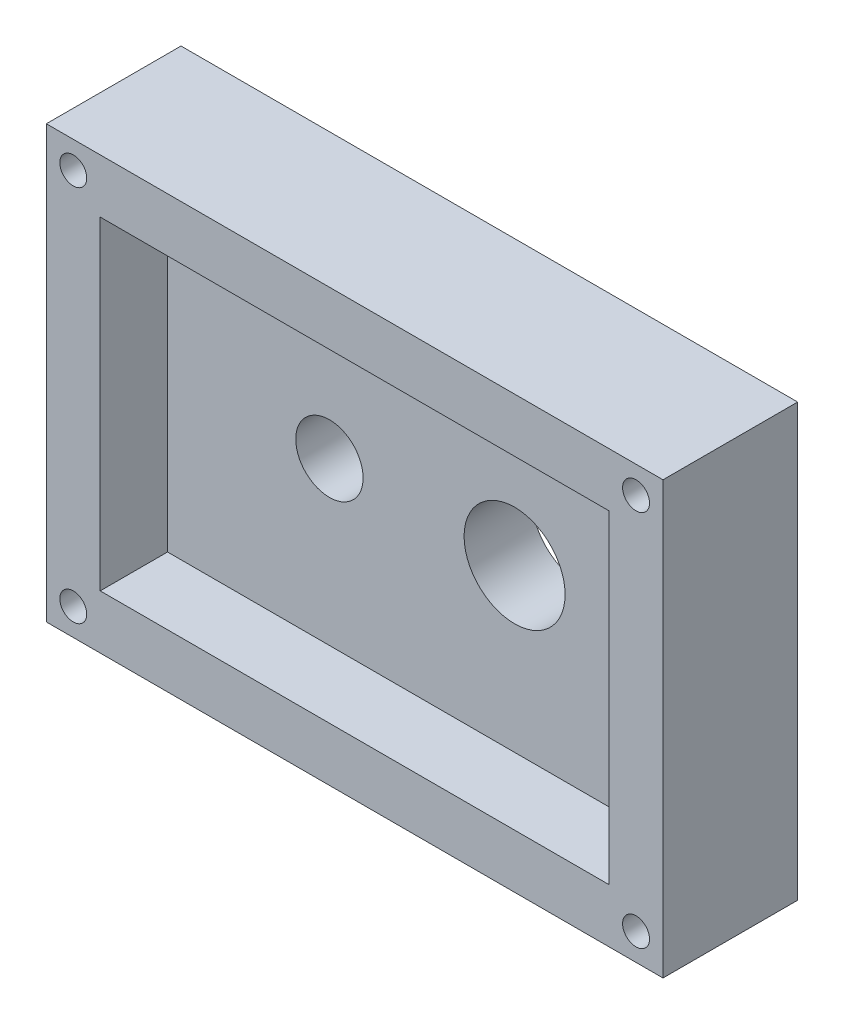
ISO-10303-21;
HEADER;
FILE_DESCRIPTION(('STEP AP214'),'2;1');
FILE_NAME('part.step','',(''),(''),'','','');
FILE_SCHEMA(('AUTOMOTIVE_DESIGN { 1 0 10303 214 1 1 1 1 }'));
ENDSEC;
DATA;
#1=APPLICATION_CONTEXT('core data for automotive mechanical design processes');
#2=APPLICATION_PROTOCOL_DEFINITION('international standard','automotive_design',2000,#1);
#3=PRODUCT_CONTEXT('',#1,'mechanical');
#4=PRODUCT('Part','Part','',(#3));
#5=PRODUCT_RELATED_PRODUCT_CATEGORY('part','',(#4));
#6=PRODUCT_DEFINITION_FORMATION('','',#4);
#7=PRODUCT_DEFINITION_CONTEXT('part definition',#1,'design');
#8=PRODUCT_DEFINITION('design','',#6,#7);
#9=PRODUCT_DEFINITION_SHAPE('','',#8);
#10=(LENGTH_UNIT() NAMED_UNIT(*) SI_UNIT(.MILLI.,.METRE.));
#11=(NAMED_UNIT(*) PLANE_ANGLE_UNIT() SI_UNIT($,.RADIAN.));
#12=(NAMED_UNIT(*) SI_UNIT($,.STERADIAN.) SOLID_ANGLE_UNIT());
#13=UNCERTAINTY_MEASURE_WITH_UNIT(LENGTH_MEASURE(1.E-05),#10,'distance_accuracy_value','');
#14=(GEOMETRIC_REPRESENTATION_CONTEXT(3) GLOBAL_UNCERTAINTY_ASSIGNED_CONTEXT((#13)) GLOBAL_UNIT_ASSIGNED_CONTEXT((#10,
#11,#12)) REPRESENTATION_CONTEXT('',''));
#15=CARTESIAN_POINT('',(0.,0.,0.));
#16=DIRECTION('',(0.,0.,1.));
#17=DIRECTION('',(1.,0.,0.));
#18=AXIS2_PLACEMENT_3D('',#15,#16,#17);
#19=CARTESIAN_POINT('',(29.07665,-20.3454,-12.7));
#20=DIRECTION('',(1.,0.,0.));
#21=DIRECTION('',(0.,0.,-1.));
#22=AXIS2_PLACEMENT_3D('',#19,#20,#21);
#23=PLANE('',#22);
#24=DIRECTION('',(0.,1.,0.));
#25=VECTOR('',#24,1.);
#26=CARTESIAN_POINT('',(29.07665,-20.3454,0.));
#27=LINE('',#26,#25);
#28=CARTESIAN_POINT('',(29.07665,-20.3454,0.));
#29=VERTEX_POINT('',#28);
#30=CARTESIAN_POINT('',(29.07665,20.3454,0.));
#31=VERTEX_POINT('',#30);
#32=EDGE_CURVE('E155',#29,#31,#27,.T.);
#33=ORIENTED_EDGE('',*,*,#32,.F.);
#34=DIRECTION('',(0.,0.,1.));
#35=VECTOR('',#34,1.);
#36=CARTESIAN_POINT('',(29.07665,-20.3454,-12.7));
#37=LINE('',#36,#35);
#38=CARTESIAN_POINT('',(29.07665,-20.3454,-12.7));
#39=VERTEX_POINT('',#38);
#40=EDGE_CURVE('E11',#39,#29,#37,.T.);
#41=ORIENTED_EDGE('',*,*,#40,.F.);
#42=DIRECTION('',(0.,1.,0.));
#43=VECTOR('',#42,1.);
#44=CARTESIAN_POINT('',(29.07665,-20.3454,-12.7));
#45=LINE('',#44,#43);
#46=CARTESIAN_POINT('',(29.07665,20.3454,-12.7));
#47=VERTEX_POINT('',#46);
#48=EDGE_CURVE('E156',#39,#47,#45,.T.);
#49=ORIENTED_EDGE('',*,*,#48,.T.);
#50=DIRECTION('',(0.,0.,1.));
#51=VECTOR('',#50,1.);
#52=CARTESIAN_POINT('',(29.07665,20.3454,-12.7));
#53=LINE('',#52,#51);
#54=EDGE_CURVE('E89',#47,#31,#53,.T.);
#55=ORIENTED_EDGE('',*,*,#54,.T.);
#56=EDGE_LOOP('',(#33,#41,#49,#55));
#57=FACE_BOUND('',#56,.T.);
#58=ADVANCED_FACE('F41',(#57),#23,.T.);
#59=CARTESIAN_POINT('',(-29.07665,-20.3454,-12.7));
#60=DIRECTION('',(0.,-1.,0.));
#61=DIRECTION('',(0.,0.,-1.));
#62=AXIS2_PLACEMENT_3D('',#59,#60,#61);
#63=PLANE('',#62);
#64=DIRECTION('',(1.,0.,0.));
#65=VECTOR('',#64,1.);
#66=CARTESIAN_POINT('',(-29.07665,-20.3454,0.));
#67=LINE('',#66,#65);
#68=CARTESIAN_POINT('',(-29.07665,-20.3454,0.));
#69=VERTEX_POINT('',#68);
#70=EDGE_CURVE('E157',#69,#29,#67,.T.);
#71=ORIENTED_EDGE('',*,*,#70,.F.);
#72=DIRECTION('',(0.,0.,1.));
#73=VECTOR('',#72,1.);
#74=CARTESIAN_POINT('',(-29.07665,-20.3454,-12.7));
#75=LINE('',#74,#73);
#76=CARTESIAN_POINT('',(-29.07665,-20.3454,-12.7));
#77=VERTEX_POINT('',#76);
#78=EDGE_CURVE('E47',#77,#69,#75,.T.);
#79=ORIENTED_EDGE('',*,*,#78,.F.);
#80=DIRECTION('',(1.,0.,0.));
#81=VECTOR('',#80,1.);
#82=CARTESIAN_POINT('',(-29.07665,-20.3454,-12.7));
#83=LINE('',#82,#81);
#84=EDGE_CURVE('E163',#77,#39,#83,.T.);
#85=ORIENTED_EDGE('',*,*,#84,.T.);
#86=ORIENTED_EDGE('',*,*,#40,.T.);
#87=EDGE_LOOP('',(#71,#79,#85,#86));
#88=FACE_BOUND('',#87,.T.);
#89=ADVANCED_FACE('F235',(#88),#63,.T.);
#90=CARTESIAN_POINT('',(-29.07665,-20.3454,-12.7));
#91=DIRECTION('',(-1.,0.,0.));
#92=DIRECTION('',(0.,0.,1.));
#93=AXIS2_PLACEMENT_3D('',#90,#91,#92);
#94=PLANE('',#93);
#95=DIRECTION('',(0.,-1.,0.));
#96=VECTOR('',#95,1.);
#97=CARTESIAN_POINT('',(-29.07665,-20.3454,0.));
#98=LINE('',#97,#96);
#99=CARTESIAN_POINT('',(-29.07665,20.3454,0.));
#100=VERTEX_POINT('',#99);
#101=EDGE_CURVE('E174',#100,#69,#98,.T.);
#102=ORIENTED_EDGE('',*,*,#101,.F.);
#103=DIRECTION('',(0.,0.,1.));
#104=VECTOR('',#103,1.);
#105=CARTESIAN_POINT('',(-29.07665,20.3454,-12.7));
#106=LINE('',#105,#104);
#107=CARTESIAN_POINT('',(-29.07665,20.3454,-12.7));
#108=VERTEX_POINT('',#107);
#109=EDGE_CURVE('E180',#108,#100,#106,.T.);
#110=ORIENTED_EDGE('',*,*,#109,.F.);
#111=DIRECTION('',(0.,-1.,0.));
#112=VECTOR('',#111,1.);
#113=CARTESIAN_POINT('',(-29.07665,-20.3454,-12.7));
#114=LINE('',#113,#112);
#115=EDGE_CURVE('E161',#108,#77,#114,.T.);
#116=ORIENTED_EDGE('',*,*,#115,.T.);
#117=ORIENTED_EDGE('',*,*,#78,.T.);
#118=EDGE_LOOP('',(#102,#110,#116,#117));
#119=FACE_BOUND('',#118,.T.);
#120=ADVANCED_FACE('F232',(#119),#94,.T.);
#121=CARTESIAN_POINT('',(-29.07665,20.3454,-12.7));
#122=DIRECTION('',(0.,1.,0.));
#123=DIRECTION('',(0.,0.,1.));
#124=AXIS2_PLACEMENT_3D('',#121,#122,#123);
#125=PLANE('',#124);
#126=DIRECTION('',(-1.,0.,0.));
#127=VECTOR('',#126,1.);
#128=CARTESIAN_POINT('',(-29.07665,20.3454,0.));
#129=LINE('',#128,#127);
#130=EDGE_CURVE('E169',#31,#100,#129,.T.);
#131=ORIENTED_EDGE('',*,*,#130,.F.);
#132=ORIENTED_EDGE('',*,*,#54,.F.);
#133=DIRECTION('',(-1.,0.,0.));
#134=VECTOR('',#133,1.);
#135=CARTESIAN_POINT('',(-29.07665,20.3454,-12.7));
#136=LINE('',#135,#134);
#137=EDGE_CURVE('E158',#47,#108,#136,.T.);
#138=ORIENTED_EDGE('',*,*,#137,.T.);
#139=ORIENTED_EDGE('',*,*,#109,.T.);
#140=EDGE_LOOP('',(#131,#132,#138,#139));
#141=FACE_BOUND('',#140,.T.);
#142=ADVANCED_FACE('F226',(#141),#125,.T.);
#143=CARTESIAN_POINT('',(0.,0.,-12.7));
#144=DIRECTION('',(0.,0.,-1.));
#145=DIRECTION('',(-1.,0.,0.));
#146=AXIS2_PLACEMENT_3D('',#143,#144,#145);
#147=PLANE('',#146);
#148=CARTESIAN_POINT('',(-26.53665,17.8054,-12.7));
#149=DIRECTION('',(0.,0.,1.));
#150=DIRECTION('',(1.,0.,0.));
#151=AXIS2_PLACEMENT_3D('',#148,#149,#150);
#152=CIRCLE('',#151,1.27);
#153=CARTESIAN_POINT('',(-25.26665,17.8054,-12.7));
#154=VERTEX_POINT('',#153);
#155=EDGE_CURVE('E204',#154,#154,#152,.T.);
#156=ORIENTED_EDGE('',*,*,#155,.T.);
#157=EDGE_LOOP('',(#156));
#158=FACE_BOUND('',#157,.T.);
#159=CARTESIAN_POINT('',(26.53665,-17.8054,-12.7));
#160=DIRECTION('',(0.,0.,1.));
#161=DIRECTION('',(1.,0.,0.));
#162=AXIS2_PLACEMENT_3D('',#159,#160,#161);
#163=CIRCLE('',#162,1.27);
#164=CARTESIAN_POINT('',(27.80665,-17.8054,-12.7));
#165=VERTEX_POINT('',#164);
#166=EDGE_CURVE('E197',#165,#165,#163,.T.);
#167=ORIENTED_EDGE('',*,*,#166,.T.);
#168=EDGE_LOOP('',(#167));
#169=FACE_BOUND('',#168,.T.);
#170=CARTESIAN_POINT('',(-26.53665,-17.8054,-12.7));
#171=DIRECTION('',(0.,0.,1.));
#172=DIRECTION('',(1.,0.,0.));
#173=AXIS2_PLACEMENT_3D('',#170,#171,#172);
#174=CIRCLE('',#173,1.27);
#175=CARTESIAN_POINT('',(-25.26665,-17.8054,-12.7));
#176=VERTEX_POINT('',#175);
#177=EDGE_CURVE('E207',#176,#176,#174,.T.);
#178=ORIENTED_EDGE('',*,*,#177,.T.);
#179=EDGE_LOOP('',(#178));
#180=FACE_BOUND('',#179,.T.);
#181=CARTESIAN_POINT('',(26.53665,17.8054,-12.7));
#182=DIRECTION('',(0.,0.,1.));
#183=DIRECTION('',(1.,0.,0.));
#184=AXIS2_PLACEMENT_3D('',#181,#182,#183);
#185=CIRCLE('',#184,1.27);
#186=CARTESIAN_POINT('',(27.80665,17.8054,-12.7));
#187=VERTEX_POINT('',#186);
#188=EDGE_CURVE('E188',#187,#187,#185,.T.);
#189=ORIENTED_EDGE('',*,*,#188,.T.);
#190=EDGE_LOOP('',(#189));
#191=FACE_BOUND('',#190,.T.);
#192=CARTESIAN_POINT('',(-8.73125,0.,-12.7));
#193=DIRECTION('',(0.,0.,1.));
#194=DIRECTION('',(1.,0.,0.));
#195=AXIS2_PLACEMENT_3D('',#192,#193,#194);
#196=CIRCLE('',#195,3.175);
#197=CARTESIAN_POINT('',(-5.55625,0.,-12.7));
#198=VERTEX_POINT('',#197);
#199=EDGE_CURVE('E182',#198,#198,#196,.T.);
#200=ORIENTED_EDGE('',*,*,#199,.T.);
#201=EDGE_LOOP('',(#200));
#202=FACE_BOUND('',#201,.T.);
#203=CARTESIAN_POINT('',(8.73125,0.,-12.7));
#204=DIRECTION('',(0.,0.,1.));
#205=DIRECTION('',(1.,0.,0.));
#206=AXIS2_PLACEMENT_3D('',#203,#204,#205);
#207=CIRCLE('',#206,4.7625);
#208=CARTESIAN_POINT('',(13.49375,0.,-12.7));
#209=VERTEX_POINT('',#208);
#210=EDGE_CURVE('E136',#209,#209,#207,.T.);
#211=ORIENTED_EDGE('',*,*,#210,.T.);
#212=EDGE_LOOP('',(#211));
#213=FACE_BOUND('',#212,.T.);
#214=ORIENTED_EDGE('',*,*,#48,.F.);
#215=ORIENTED_EDGE('',*,*,#84,.F.);
#216=ORIENTED_EDGE('',*,*,#115,.F.);
#217=ORIENTED_EDGE('',*,*,#137,.F.);
#218=EDGE_LOOP('',(#214,#215,#216,#217));
#219=FACE_BOUND('',#218,.T.);
#220=ADVANCED_FACE('F219',(#158,#169,#180,#191,#202,#213,#219),#147,.T.);
#221=CARTESIAN_POINT('',(0.,0.,0.));
#222=DIRECTION('',(0.,0.,-1.));
#223=DIRECTION('',(-1.,0.,0.));
#224=AXIS2_PLACEMENT_3D('',#221,#222,#223);
#225=PLANE('',#224);
#226=CARTESIAN_POINT('',(-26.53665,17.8054,0.));
#227=DIRECTION('',(0.,0.,1.));
#228=DIRECTION('',(1.,0.,0.));
#229=AXIS2_PLACEMENT_3D('',#226,#227,#228);
#230=CIRCLE('',#229,1.27);
#231=CARTESIAN_POINT('',(-25.26665,17.8054,0.));
#232=VERTEX_POINT('',#231);
#233=EDGE_CURVE('E194',#232,#232,#230,.T.);
#234=ORIENTED_EDGE('',*,*,#233,.F.);
#235=EDGE_LOOP('',(#234));
#236=FACE_BOUND('',#235,.T.);
#237=CARTESIAN_POINT('',(26.53665,-17.8054,0.));
#238=DIRECTION('',(0.,0.,1.));
#239=DIRECTION('',(1.,0.,0.));
#240=AXIS2_PLACEMENT_3D('',#237,#238,#239);
#241=CIRCLE('',#240,1.27);
#242=CARTESIAN_POINT('',(27.80665,-17.8054,0.));
#243=VERTEX_POINT('',#242);
#244=EDGE_CURVE('E199',#243,#243,#241,.T.);
#245=ORIENTED_EDGE('',*,*,#244,.F.);
#246=EDGE_LOOP('',(#245));
#247=FACE_BOUND('',#246,.T.);
#248=CARTESIAN_POINT('',(-26.53665,-17.8054,0.));
#249=DIRECTION('',(0.,0.,1.));
#250=DIRECTION('',(1.,0.,0.));
#251=AXIS2_PLACEMENT_3D('',#248,#249,#250);
#252=CIRCLE('',#251,1.27);
#253=CARTESIAN_POINT('',(-25.26665,-17.8054,0.));
#254=VERTEX_POINT('',#253);
#255=EDGE_CURVE('E203',#254,#254,#252,.T.);
#256=ORIENTED_EDGE('',*,*,#255,.F.);
#257=EDGE_LOOP('',(#256));
#258=FACE_BOUND('',#257,.T.);
#259=CARTESIAN_POINT('',(26.53665,17.8054,0.));
#260=DIRECTION('',(0.,0.,1.));
#261=DIRECTION('',(1.,0.,0.));
#262=AXIS2_PLACEMENT_3D('',#259,#260,#261);
#263=CIRCLE('',#262,1.27);
#264=CARTESIAN_POINT('',(27.80665,17.8054,0.));
#265=VERTEX_POINT('',#264);
#266=EDGE_CURVE('E192',#265,#265,#263,.T.);
#267=ORIENTED_EDGE('',*,*,#266,.F.);
#268=EDGE_LOOP('',(#267));
#269=FACE_BOUND('',#268,.T.);
#270=DIRECTION('',(-1.,0.,0.));
#271=VECTOR('',#270,1.);
#272=CARTESIAN_POINT('',(-23.99665,15.2654,0.));
#273=LINE('',#272,#271);
#274=CARTESIAN_POINT('',(23.99665,15.2654,0.));
#275=VERTEX_POINT('',#274);
#276=CARTESIAN_POINT('',(-23.99665,15.2654,0.));
#277=VERTEX_POINT('',#276);
#278=EDGE_CURVE('E148',#275,#277,#273,.T.);
#279=ORIENTED_EDGE('',*,*,#278,.F.);
#280=DIRECTION('',(0.,1.,0.));
#281=VECTOR('',#280,1.);
#282=CARTESIAN_POINT('',(23.99665,-15.2654,0.));
#283=LINE('',#282,#281);
#284=CARTESIAN_POINT('',(23.99665,-15.2654,0.));
#285=VERTEX_POINT('',#284);
#286=EDGE_CURVE('E60',#285,#275,#283,.T.);
#287=ORIENTED_EDGE('',*,*,#286,.F.);
#288=DIRECTION('',(1.,0.,0.));
#289=VECTOR('',#288,1.);
#290=CARTESIAN_POINT('',(-23.99665,-15.2654,0.));
#291=LINE('',#290,#289);
#292=CARTESIAN_POINT('',(-23.99665,-15.2654,0.));
#293=VERTEX_POINT('',#292);
#294=EDGE_CURVE('E133',#293,#285,#291,.T.);
#295=ORIENTED_EDGE('',*,*,#294,.F.);
#296=DIRECTION('',(0.,-1.,0.));
#297=VECTOR('',#296,1.);
#298=CARTESIAN_POINT('',(-23.99665,-15.2654,0.));
#299=LINE('',#298,#297);
#300=EDGE_CURVE('E140',#277,#293,#299,.T.);
#301=ORIENTED_EDGE('',*,*,#300,.F.);
#302=EDGE_LOOP('',(#279,#287,#295,#301));
#303=FACE_BOUND('',#302,.T.);
#304=ORIENTED_EDGE('',*,*,#32,.T.);
#305=ORIENTED_EDGE('',*,*,#130,.T.);
#306=ORIENTED_EDGE('',*,*,#101,.T.);
#307=ORIENTED_EDGE('',*,*,#70,.T.);
#308=EDGE_LOOP('',(#304,#305,#306,#307));
#309=FACE_BOUND('',#308,.T.);
#310=ADVANCED_FACE('F220',(#236,#247,#258,#269,#303,#309),#225,.F.);
#311=CARTESIAN_POINT('',(23.99665,-15.2654,-6.35));
#312=DIRECTION('',(1.,0.,0.));
#313=DIRECTION('',(0.,0.,-1.));
#314=AXIS2_PLACEMENT_3D('',#311,#312,#313);
#315=PLANE('',#314);
#316=ORIENTED_EDGE('',*,*,#286,.T.);
#317=DIRECTION('',(0.,0.,1.));
#318=VECTOR('',#317,1.);
#319=CARTESIAN_POINT('',(23.99665,15.2654,-6.35));
#320=LINE('',#319,#318);
#321=CARTESIAN_POINT('',(23.99665,15.2654,-6.35));
#322=VERTEX_POINT('',#321);
#323=EDGE_CURVE('E115',#322,#275,#320,.T.);
#324=ORIENTED_EDGE('',*,*,#323,.F.);
#325=DIRECTION('',(0.,1.,0.));
#326=VECTOR('',#325,1.);
#327=CARTESIAN_POINT('',(23.99665,-15.2654,-6.35));
#328=LINE('',#327,#326);
#329=CARTESIAN_POINT('',(23.99665,-15.2654,-6.35));
#330=VERTEX_POINT('',#329);
#331=EDGE_CURVE('E119',#330,#322,#328,.T.);
#332=ORIENTED_EDGE('',*,*,#331,.F.);
#333=DIRECTION('',(0.,0.,1.));
#334=VECTOR('',#333,1.);
#335=CARTESIAN_POINT('',(23.99665,-15.2654,-6.35));
#336=LINE('',#335,#334);
#337=EDGE_CURVE('E147',#330,#285,#336,.T.);
#338=ORIENTED_EDGE('',*,*,#337,.T.);
#339=EDGE_LOOP('',(#316,#324,#332,#338));
#340=FACE_BOUND('',#339,.T.);
#341=ADVANCED_FACE('F111',(#340),#315,.F.);
#342=CARTESIAN_POINT('',(-23.99665,-15.2654,-6.35));
#343=DIRECTION('',(0.,-1.,0.));
#344=DIRECTION('',(0.,0.,-1.));
#345=AXIS2_PLACEMENT_3D('',#342,#343,#344);
#346=PLANE('',#345);
#347=ORIENTED_EDGE('',*,*,#294,.T.);
#348=ORIENTED_EDGE('',*,*,#337,.F.);
#349=DIRECTION('',(1.,0.,0.));
#350=VECTOR('',#349,1.);
#351=CARTESIAN_POINT('',(-23.99665,-15.2654,-6.35));
#352=LINE('',#351,#350);
#353=CARTESIAN_POINT('',(-23.99665,-15.2654,-6.35));
#354=VERTEX_POINT('',#353);
#355=EDGE_CURVE('E125',#354,#330,#352,.T.);
#356=ORIENTED_EDGE('',*,*,#355,.F.);
#357=DIRECTION('',(0.,0.,1.));
#358=VECTOR('',#357,1.);
#359=CARTESIAN_POINT('',(-23.99665,-15.2654,-6.35));
#360=LINE('',#359,#358);
#361=EDGE_CURVE('E153',#354,#293,#360,.T.);
#362=ORIENTED_EDGE('',*,*,#361,.T.);
#363=EDGE_LOOP('',(#347,#348,#356,#362));
#364=FACE_BOUND('',#363,.T.);
#365=ADVANCED_FACE('F270',(#364),#346,.F.);
#366=CARTESIAN_POINT('',(-23.99665,-15.2654,-6.35));
#367=DIRECTION('',(-1.,0.,0.));
#368=DIRECTION('',(0.,0.,1.));
#369=AXIS2_PLACEMENT_3D('',#366,#367,#368);
#370=PLANE('',#369);
#371=ORIENTED_EDGE('',*,*,#300,.T.);
#372=ORIENTED_EDGE('',*,*,#361,.F.);
#373=DIRECTION('',(0.,-1.,0.));
#374=VECTOR('',#373,1.);
#375=CARTESIAN_POINT('',(-23.99665,-15.2654,-6.35));
#376=LINE('',#375,#374);
#377=CARTESIAN_POINT('',(-23.99665,15.2654,-6.35));
#378=VERTEX_POINT('',#377);
#379=EDGE_CURVE('E128',#378,#354,#376,.T.);
#380=ORIENTED_EDGE('',*,*,#379,.F.);
#381=DIRECTION('',(0.,0.,1.));
#382=VECTOR('',#381,1.);
#383=CARTESIAN_POINT('',(-23.99665,15.2654,-6.35));
#384=LINE('',#383,#382);
#385=EDGE_CURVE('E122',#378,#277,#384,.T.);
#386=ORIENTED_EDGE('',*,*,#385,.T.);
#387=EDGE_LOOP('',(#371,#372,#380,#386));
#388=FACE_BOUND('',#387,.T.);
#389=ADVANCED_FACE('F274',(#388),#370,.F.);
#390=CARTESIAN_POINT('',(-23.99665,15.2654,-6.35));
#391=DIRECTION('',(0.,1.,0.));
#392=DIRECTION('',(0.,0.,1.));
#393=AXIS2_PLACEMENT_3D('',#390,#391,#392);
#394=PLANE('',#393);
#395=ORIENTED_EDGE('',*,*,#278,.T.);
#396=ORIENTED_EDGE('',*,*,#385,.F.);
#397=DIRECTION('',(-1.,0.,0.));
#398=VECTOR('',#397,1.);
#399=CARTESIAN_POINT('',(-23.99665,15.2654,-6.35));
#400=LINE('',#399,#398);
#401=EDGE_CURVE('E121',#322,#378,#400,.T.);
#402=ORIENTED_EDGE('',*,*,#401,.F.);
#403=ORIENTED_EDGE('',*,*,#323,.T.);
#404=EDGE_LOOP('',(#395,#396,#402,#403));
#405=FACE_BOUND('',#404,.T.);
#406=ADVANCED_FACE('F127',(#405),#394,.F.);
#407=CARTESIAN_POINT('',(0.,0.,-6.35));
#408=DIRECTION('',(0.,0.,-1.));
#409=DIRECTION('',(-1.,0.,0.));
#410=AXIS2_PLACEMENT_3D('',#407,#408,#409);
#411=PLANE('',#410);
#412=CARTESIAN_POINT('',(-8.73125,0.,-6.35));
#413=DIRECTION('',(0.,0.,-1.));
#414=DIRECTION('',(-1.,0.,0.));
#415=AXIS2_PLACEMENT_3D('',#412,#413,#414);
#416=CIRCLE('',#415,3.175);
#417=CARTESIAN_POINT('',(-11.90625,0.,-6.35));
#418=VERTEX_POINT('',#417);
#419=EDGE_CURVE('E42',#418,#418,#416,.T.);
#420=ORIENTED_EDGE('',*,*,#419,.T.);
#421=EDGE_LOOP('',(#420));
#422=FACE_BOUND('',#421,.T.);
#423=CARTESIAN_POINT('',(8.73125,0.,-6.35));
#424=DIRECTION('',(0.,0.,-1.));
#425=DIRECTION('',(-1.,0.,0.));
#426=AXIS2_PLACEMENT_3D('',#423,#424,#425);
#427=CIRCLE('',#426,4.7625);
#428=CARTESIAN_POINT('',(3.96875,0.,-6.35));
#429=VERTEX_POINT('',#428);
#430=EDGE_CURVE('E179',#429,#429,#427,.T.);
#431=ORIENTED_EDGE('',*,*,#430,.T.);
#432=EDGE_LOOP('',(#431));
#433=FACE_BOUND('',#432,.T.);
#434=ORIENTED_EDGE('',*,*,#331,.T.);
#435=ORIENTED_EDGE('',*,*,#401,.T.);
#436=ORIENTED_EDGE('',*,*,#379,.T.);
#437=ORIENTED_EDGE('',*,*,#355,.T.);
#438=EDGE_LOOP('',(#434,#435,#436,#437));
#439=FACE_BOUND('',#438,.T.);
#440=ADVANCED_FACE('F131',(#422,#433,#439),#411,.F.);
#441=CARTESIAN_POINT('',(8.73125,0.,-12.7));
#442=DIRECTION('',(0.,0.,1.));
#443=DIRECTION('',(1.,0.,0.));
#444=AXIS2_PLACEMENT_3D('',#441,#442,#443);
#445=CYLINDRICAL_SURFACE('',#444,4.7625);
#446=ORIENTED_EDGE('',*,*,#210,.F.);
#447=EDGE_LOOP('',(#446));
#448=FACE_BOUND('',#447,.T.);
#449=ORIENTED_EDGE('',*,*,#430,.F.);
#450=EDGE_LOOP('',(#449));
#451=FACE_BOUND('',#450,.T.);
#452=ADVANCED_FACE('F298',(#448,#451),#445,.F.);
#453=CARTESIAN_POINT('',(-8.73125,0.,-12.7));
#454=DIRECTION('',(0.,0.,1.));
#455=DIRECTION('',(1.,0.,0.));
#456=AXIS2_PLACEMENT_3D('',#453,#454,#455);
#457=CYLINDRICAL_SURFACE('',#456,3.175);
#458=ORIENTED_EDGE('',*,*,#199,.F.);
#459=EDGE_LOOP('',(#458));
#460=FACE_BOUND('',#459,.T.);
#461=ORIENTED_EDGE('',*,*,#419,.F.);
#462=EDGE_LOOP('',(#461));
#463=FACE_BOUND('',#462,.T.);
#464=ADVANCED_FACE('F307',(#460,#463),#457,.F.);
#465=CARTESIAN_POINT('',(26.53665,17.8054,-12.7));
#466=DIRECTION('',(0.,0.,1.));
#467=DIRECTION('',(1.,0.,0.));
#468=AXIS2_PLACEMENT_3D('',#465,#466,#467);
#469=CYLINDRICAL_SURFACE('',#468,1.27);
#470=ORIENTED_EDGE('',*,*,#188,.F.);
#471=EDGE_LOOP('',(#470));
#472=FACE_BOUND('',#471,.T.);
#473=ORIENTED_EDGE('',*,*,#266,.T.);
#474=EDGE_LOOP('',(#473));
#475=FACE_BOUND('',#474,.T.);
#476=ADVANCED_FACE('F312',(#472,#475),#469,.F.);
#477=CARTESIAN_POINT('',(-26.53665,-17.8054,-12.7));
#478=DIRECTION('',(0.,0.,1.));
#479=DIRECTION('',(1.,0.,0.));
#480=AXIS2_PLACEMENT_3D('',#477,#478,#479);
#481=CYLINDRICAL_SURFACE('',#480,1.27);
#482=ORIENTED_EDGE('',*,*,#177,.F.);
#483=EDGE_LOOP('',(#482));
#484=FACE_BOUND('',#483,.T.);
#485=ORIENTED_EDGE('',*,*,#255,.T.);
#486=EDGE_LOOP('',(#485));
#487=FACE_BOUND('',#486,.T.);
#488=ADVANCED_FACE('F214',(#484,#487),#481,.F.);
#489=CARTESIAN_POINT('',(26.53665,-17.8054,-12.7));
#490=DIRECTION('',(0.,0.,1.));
#491=DIRECTION('',(1.,0.,0.));
#492=AXIS2_PLACEMENT_3D('',#489,#490,#491);
#493=CYLINDRICAL_SURFACE('',#492,1.27);
#494=ORIENTED_EDGE('',*,*,#166,.F.);
#495=EDGE_LOOP('',(#494));
#496=FACE_BOUND('',#495,.T.);
#497=ORIENTED_EDGE('',*,*,#244,.T.);
#498=EDGE_LOOP('',(#497));
#499=FACE_BOUND('',#498,.T.);
#500=ADVANCED_FACE('F336',(#496,#499),#493,.F.);
#501=CARTESIAN_POINT('',(-26.53665,17.8054,-12.7));
#502=DIRECTION('',(0.,0.,1.));
#503=DIRECTION('',(1.,0.,0.));
#504=AXIS2_PLACEMENT_3D('',#501,#502,#503);
#505=CYLINDRICAL_SURFACE('',#504,1.27);
#506=ORIENTED_EDGE('',*,*,#155,.F.);
#507=EDGE_LOOP('',(#506));
#508=FACE_BOUND('',#507,.T.);
#509=ORIENTED_EDGE('',*,*,#233,.T.);
#510=EDGE_LOOP('',(#509));
#511=FACE_BOUND('',#510,.T.);
#512=ADVANCED_FACE('F350',(#508,#511),#505,.F.);
#513=CLOSED_SHELL('',(#58,#89,#120,#142,#220,#310,#341,#365,#389,#406,#440,#452,#464,#476,#488,
#500,#512));
#514=MANIFOLD_SOLID_BREP('B2',#513);
#515=ADVANCED_BREP_SHAPE_REPRESENTATION('',(#18,#514),#14);
#516=SHAPE_DEFINITION_REPRESENTATION(#9,#515);
ENDSEC;
END-ISO-10303-21;
